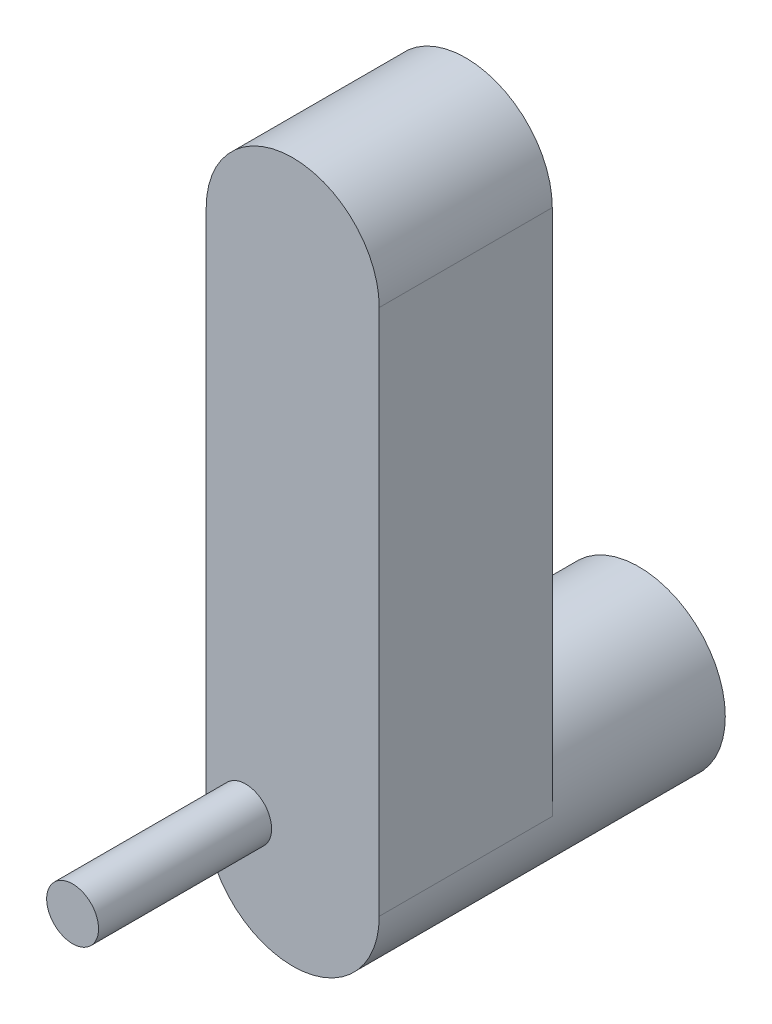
from build123d import *

# Parameters (mm, degrees)
SKETCH1_R           = 5
BOSS_EXTRUDE1_DEPTH = 20
BOSS_EXTRUDE2_DEPTH = 10
SKETCH3_R           = 1.5
BOSS_EXTRUDE3_DEPTH = 10


with BuildPart() as part:
    # Sketch1 → Boss-Extrude1 (new body)
    with BuildSketch(Plane.XY):
        Circle(SKETCH1_R)
    extrude(amount=BOSS_EXTRUDE1_DEPTH)

    # Sketch2 → Boss-Extrude2 (add)
    with BuildSketch(Plane.XY.offset(10)):
        with BuildLine():
            Line((-5, 0), (-5, 30.469644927))
            ThreePointArc((-5, 30.469644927), (0, 35.469644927), (5, 30.469644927))
            Line((5, 30.469644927), (5, 0))
            ThreePointArc((5, 0), (0, -5), (-5, 0))
        make_face()
    extrude(amount=BOSS_EXTRUDE2_DEPTH)

    # Sketch3 → Boss-Extrude3 (add)
    with BuildSketch(Plane.XY.offset(20)):
        with Locations((-2.721861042, 1.261535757)):
            Circle(SKETCH3_R)
    extrude(amount=BOSS_EXTRUDE3_DEPTH)


solid = part.part
